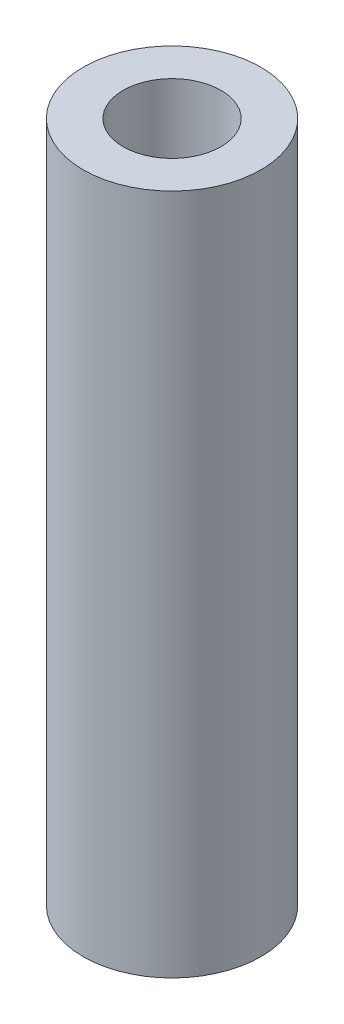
ISO-10303-21;
HEADER;
FILE_DESCRIPTION(('STEP AP214'),'2;1');
FILE_NAME('part.step','',(''),(''),'','','');
FILE_SCHEMA(('AUTOMOTIVE_DESIGN { 1 0 10303 214 1 1 1 1 }'));
ENDSEC;
DATA;
#1=APPLICATION_CONTEXT('core data for automotive mechanical design processes');
#2=APPLICATION_PROTOCOL_DEFINITION('international standard','automotive_design',2000,#1);
#3=PRODUCT_CONTEXT('',#1,'mechanical');
#4=PRODUCT('Part','Part','',(#3));
#5=PRODUCT_RELATED_PRODUCT_CATEGORY('part','',(#4));
#6=PRODUCT_DEFINITION_FORMATION('','',#4);
#7=PRODUCT_DEFINITION_CONTEXT('part definition',#1,'design');
#8=PRODUCT_DEFINITION('design','',#6,#7);
#9=PRODUCT_DEFINITION_SHAPE('','',#8);
#10=(LENGTH_UNIT() NAMED_UNIT(*) SI_UNIT(.MILLI.,.METRE.));
#11=(NAMED_UNIT(*) PLANE_ANGLE_UNIT() SI_UNIT($,.RADIAN.));
#12=(NAMED_UNIT(*) SI_UNIT($,.STERADIAN.) SOLID_ANGLE_UNIT());
#13=UNCERTAINTY_MEASURE_WITH_UNIT(LENGTH_MEASURE(1.E-05),#10,'distance_accuracy_value','');
#14=(GEOMETRIC_REPRESENTATION_CONTEXT(3) GLOBAL_UNCERTAINTY_ASSIGNED_CONTEXT((#13)) GLOBAL_UNIT_ASSIGNED_CONTEXT((#10,
#11,#12)) REPRESENTATION_CONTEXT('',''));
#15=CARTESIAN_POINT('',(0.,0.,0.));
#16=DIRECTION('',(0.,0.,1.));
#17=DIRECTION('',(1.,0.,0.));
#18=AXIS2_PLACEMENT_3D('',#15,#16,#17);
#19=CARTESIAN_POINT('',(0.,0.5,0.));
#20=DIRECTION('',(0.,1.,0.));
#21=DIRECTION('',(0.,0.,1.));
#22=AXIS2_PLACEMENT_3D('',#19,#20,#21);
#23=PLANE('',#22);
#24=CARTESIAN_POINT('',(0.,0.5,0.));
#25=DIRECTION('',(0.,1.,0.));
#26=DIRECTION('',(0.,0.,1.));
#27=AXIS2_PLACEMENT_3D('',#24,#25,#26);
#28=CIRCLE('',#27,3.);
#29=CARTESIAN_POINT('',(0.,0.5,3.));
#30=VERTEX_POINT('',#29);
#31=EDGE_CURVE('E11',#30,#30,#28,.T.);
#32=ORIENTED_EDGE('',*,*,#31,.T.);
#33=EDGE_LOOP('',(#32));
#34=FACE_BOUND('',#33,.T.);
#35=CARTESIAN_POINT('',(0.,0.5,0.));
#36=DIRECTION('',(0.,1.,0.));
#37=DIRECTION('',(0.,0.,1.));
#38=AXIS2_PLACEMENT_3D('',#35,#36,#37);
#39=CIRCLE('',#38,1.65);
#40=CARTESIAN_POINT('',(0.,0.5,1.65));
#41=VERTEX_POINT('',#40);
#42=EDGE_CURVE('E62',#41,#41,#39,.T.);
#43=ORIENTED_EDGE('',*,*,#42,.F.);
#44=EDGE_LOOP('',(#43));
#45=FACE_BOUND('',#44,.T.);
#46=ADVANCED_FACE('F51',(#34,#45),#23,.T.);
#47=CARTESIAN_POINT('',(0.,0.,0.));
#48=DIRECTION('',(0.,1.,0.));
#49=DIRECTION('',(0.,0.,1.));
#50=AXIS2_PLACEMENT_3D('',#47,#48,#49);
#51=PLANE('',#50);
#52=CARTESIAN_POINT('',(0.,0.,0.));
#53=DIRECTION('',(0.,1.,0.));
#54=DIRECTION('',(0.,0.,1.));
#55=AXIS2_PLACEMENT_3D('',#52,#53,#54);
#56=CIRCLE('',#55,3.);
#57=CARTESIAN_POINT('',(0.,0.,3.));
#58=VERTEX_POINT('',#57);
#59=EDGE_CURVE('E55',#58,#58,#56,.T.);
#60=ORIENTED_EDGE('',*,*,#59,.F.);
#61=EDGE_LOOP('',(#60));
#62=FACE_BOUND('',#61,.T.);
#63=CARTESIAN_POINT('',(0.,0.,0.));
#64=DIRECTION('',(0.,1.,0.));
#65=DIRECTION('',(0.,0.,1.));
#66=AXIS2_PLACEMENT_3D('',#63,#64,#65);
#67=CIRCLE('',#66,1.65);
#68=CARTESIAN_POINT('',(0.,0.,1.65));
#69=VERTEX_POINT('',#68);
#70=EDGE_CURVE('E64',#69,#69,#67,.T.);
#71=ORIENTED_EDGE('',*,*,#70,.T.);
#72=EDGE_LOOP('',(#71));
#73=FACE_BOUND('',#72,.T.);
#74=ADVANCED_FACE('F74',(#62,#73),#51,.F.);
#75=CARTESIAN_POINT('',(0.,0.5,0.));
#76=DIRECTION('',(0.,-1.,0.));
#77=DIRECTION('',(0.,0.,-1.));
#78=AXIS2_PLACEMENT_3D('',#75,#76,#77);
#79=CYLINDRICAL_SURFACE('',#78,3.);
#80=ORIENTED_EDGE('',*,*,#31,.F.);
#81=EDGE_LOOP('',(#80));
#82=FACE_BOUND('',#81,.T.);
#83=ORIENTED_EDGE('',*,*,#59,.T.);
#84=EDGE_LOOP('',(#83));
#85=FACE_BOUND('',#84,.T.);
#86=ADVANCED_FACE('F53',(#82,#85),#79,.T.);
#87=CARTESIAN_POINT('',(0.,0.5,0.));
#88=DIRECTION('',(0.,-1.,0.));
#89=DIRECTION('',(0.,0.,-1.));
#90=AXIS2_PLACEMENT_3D('',#87,#88,#89);
#91=CYLINDRICAL_SURFACE('',#90,1.65);
#92=ORIENTED_EDGE('',*,*,#42,.T.);
#93=EDGE_LOOP('',(#92));
#94=FACE_BOUND('',#93,.T.);
#95=ORIENTED_EDGE('',*,*,#70,.F.);
#96=EDGE_LOOP('',(#95));
#97=FACE_BOUND('',#96,.T.);
#98=ADVANCED_FACE('F70',(#94,#97),#91,.F.);
#99=CLOSED_SHELL('',(#46,#74,#86,#98));
#100=MANIFOLD_SOLID_BREP('B2_NOT_SHOWN',#99);
#101=CARTESIAN_POINT('',(0.,1.,0.));
#102=DIRECTION('',(0.,1.,0.));
#103=DIRECTION('',(0.,0.,1.));
#104=AXIS2_PLACEMENT_3D('',#101,#102,#103);
#105=PLANE('',#104);
#106=CARTESIAN_POINT('',(0.,1.,0.));
#107=DIRECTION('',(0.,1.,0.));
#108=DIRECTION('',(0.,0.,1.));
#109=AXIS2_PLACEMENT_3D('',#106,#107,#108);
#110=CIRCLE('',#109,3.);
#111=CARTESIAN_POINT('',(0.,1.,3.));
#112=VERTEX_POINT('',#111);
#113=EDGE_CURVE('E50',#112,#112,#110,.T.);
#114=ORIENTED_EDGE('',*,*,#113,.T.);
#115=EDGE_LOOP('',(#114));
#116=FACE_BOUND('',#115,.T.);
#117=CARTESIAN_POINT('',(0.,1.,0.));
#118=DIRECTION('',(0.,1.,0.));
#119=DIRECTION('',(0.,0.,1.));
#120=AXIS2_PLACEMENT_3D('',#117,#118,#119);
#121=CIRCLE('',#120,1.65);
#122=CARTESIAN_POINT('',(0.,1.,1.65));
#123=VERTEX_POINT('',#122);
#124=EDGE_CURVE('E140',#123,#123,#121,.T.);
#125=ORIENTED_EDGE('',*,*,#124,.F.);
#126=EDGE_LOOP('',(#125));
#127=FACE_BOUND('',#126,.T.);
#128=ADVANCED_FACE('F127',(#116,#127),#105,.T.);
#129=CARTESIAN_POINT('',(0.,0.,0.));
#130=DIRECTION('',(0.,1.,0.));
#131=DIRECTION('',(0.,0.,1.));
#132=AXIS2_PLACEMENT_3D('',#129,#130,#131);
#133=PLANE('',#132);
#134=CARTESIAN_POINT('',(0.,0.,0.));
#135=DIRECTION('',(0.,1.,0.));
#136=DIRECTION('',(0.,0.,1.));
#137=AXIS2_PLACEMENT_3D('',#134,#135,#136);
#138=CIRCLE('',#137,3.);
#139=CARTESIAN_POINT('',(0.,0.,3.));
#140=VERTEX_POINT('',#139);
#141=EDGE_CURVE('E131',#140,#140,#138,.T.);
#142=ORIENTED_EDGE('',*,*,#141,.F.);
#143=EDGE_LOOP('',(#142));
#144=FACE_BOUND('',#143,.T.);
#145=CARTESIAN_POINT('',(0.,0.,0.));
#146=DIRECTION('',(0.,1.,0.));
#147=DIRECTION('',(0.,0.,1.));
#148=AXIS2_PLACEMENT_3D('',#145,#146,#147);
#149=CIRCLE('',#148,1.65);
#150=CARTESIAN_POINT('',(0.,0.,1.65));
#151=VERTEX_POINT('',#150);
#152=EDGE_CURVE('E142',#151,#151,#149,.T.);
#153=ORIENTED_EDGE('',*,*,#152,.T.);
#154=EDGE_LOOP('',(#153));
#155=FACE_BOUND('',#154,.T.);
#156=ADVANCED_FACE('F154',(#144,#155),#133,.F.);
#157=CARTESIAN_POINT('',(0.,1.,0.));
#158=DIRECTION('',(0.,-1.,0.));
#159=DIRECTION('',(0.,0.,-1.));
#160=AXIS2_PLACEMENT_3D('',#157,#158,#159);
#161=CYLINDRICAL_SURFACE('',#160,3.);
#162=ORIENTED_EDGE('',*,*,#113,.F.);
#163=EDGE_LOOP('',(#162));
#164=FACE_BOUND('',#163,.T.);
#165=ORIENTED_EDGE('',*,*,#141,.T.);
#166=EDGE_LOOP('',(#165));
#167=FACE_BOUND('',#166,.T.);
#168=ADVANCED_FACE('F129',(#164,#167),#161,.T.);
#169=CARTESIAN_POINT('',(0.,1.,0.));
#170=DIRECTION('',(0.,-1.,0.));
#171=DIRECTION('',(0.,0.,-1.));
#172=AXIS2_PLACEMENT_3D('',#169,#170,#171);
#173=CYLINDRICAL_SURFACE('',#172,1.65);
#174=ORIENTED_EDGE('',*,*,#124,.T.);
#175=EDGE_LOOP('',(#174));
#176=FACE_BOUND('',#175,.T.);
#177=ORIENTED_EDGE('',*,*,#152,.F.);
#178=EDGE_LOOP('',(#177));
#179=FACE_BOUND('',#178,.T.);
#180=ADVANCED_FACE('F150',(#176,#179),#173,.F.);
#181=CLOSED_SHELL('',(#128,#156,#168,#180));
#182=MANIFOLD_SOLID_BREP('B6_NOT_SHOWN',#181);
#183=CARTESIAN_POINT('',(0.,23.,0.));
#184=DIRECTION('',(0.,1.,0.));
#185=DIRECTION('',(0.,0.,1.));
#186=AXIS2_PLACEMENT_3D('',#183,#184,#185);
#187=PLANE('',#186);
#188=CARTESIAN_POINT('',(0.,23.,0.));
#189=DIRECTION('',(0.,1.,0.));
#190=DIRECTION('',(0.,0.,1.));
#191=AXIS2_PLACEMENT_3D('',#188,#189,#190);
#192=CIRCLE('',#191,3.);
#193=CARTESIAN_POINT('',(0.,23.,3.));
#194=VERTEX_POINT('',#193);
#195=EDGE_CURVE('E126',#194,#194,#192,.T.);
#196=ORIENTED_EDGE('',*,*,#195,.T.);
#197=EDGE_LOOP('',(#196));
#198=FACE_BOUND('',#197,.T.);
#199=CARTESIAN_POINT('',(0.,23.,0.));
#200=DIRECTION('',(0.,1.,0.));
#201=DIRECTION('',(0.,0.,1.));
#202=AXIS2_PLACEMENT_3D('',#199,#200,#201);
#203=CIRCLE('',#202,1.65);
#204=CARTESIAN_POINT('',(0.,23.,1.65));
#205=VERTEX_POINT('',#204);
#206=EDGE_CURVE('E213',#205,#205,#203,.T.);
#207=ORIENTED_EDGE('',*,*,#206,.F.);
#208=EDGE_LOOP('',(#207));
#209=FACE_BOUND('',#208,.T.);
#210=ADVANCED_FACE('F200',(#198,#209),#187,.T.);
#211=CARTESIAN_POINT('',(0.,0.,0.));
#212=DIRECTION('',(0.,1.,0.));
#213=DIRECTION('',(0.,0.,1.));
#214=AXIS2_PLACEMENT_3D('',#211,#212,#213);
#215=PLANE('',#214);
#216=CARTESIAN_POINT('',(0.,0.,0.));
#217=DIRECTION('',(0.,1.,0.));
#218=DIRECTION('',(0.,0.,1.));
#219=AXIS2_PLACEMENT_3D('',#216,#217,#218);
#220=CIRCLE('',#219,3.);
#221=CARTESIAN_POINT('',(0.,0.,3.));
#222=VERTEX_POINT('',#221);
#223=EDGE_CURVE('E204',#222,#222,#220,.T.);
#224=ORIENTED_EDGE('',*,*,#223,.F.);
#225=EDGE_LOOP('',(#224));
#226=FACE_BOUND('',#225,.T.);
#227=CARTESIAN_POINT('',(0.,0.,0.));
#228=DIRECTION('',(0.,1.,0.));
#229=DIRECTION('',(0.,0.,1.));
#230=AXIS2_PLACEMENT_3D('',#227,#228,#229);
#231=CIRCLE('',#230,1.65);
#232=CARTESIAN_POINT('',(0.,0.,1.65));
#233=VERTEX_POINT('',#232);
#234=EDGE_CURVE('E215',#233,#233,#231,.T.);
#235=ORIENTED_EDGE('',*,*,#234,.T.);
#236=EDGE_LOOP('',(#235));
#237=FACE_BOUND('',#236,.T.);
#238=ADVANCED_FACE('F227',(#226,#237),#215,.F.);
#239=CARTESIAN_POINT('',(0.,23.,0.));
#240=DIRECTION('',(0.,-1.,0.));
#241=DIRECTION('',(0.,0.,-1.));
#242=AXIS2_PLACEMENT_3D('',#239,#240,#241);
#243=CYLINDRICAL_SURFACE('',#242,3.);
#244=ORIENTED_EDGE('',*,*,#195,.F.);
#245=EDGE_LOOP('',(#244));
#246=FACE_BOUND('',#245,.T.);
#247=ORIENTED_EDGE('',*,*,#223,.T.);
#248=EDGE_LOOP('',(#247));
#249=FACE_BOUND('',#248,.T.);
#250=ADVANCED_FACE('F202',(#246,#249),#243,.T.);
#251=CARTESIAN_POINT('',(0.,23.,0.));
#252=DIRECTION('',(0.,-1.,0.));
#253=DIRECTION('',(0.,0.,-1.));
#254=AXIS2_PLACEMENT_3D('',#251,#252,#253);
#255=CYLINDRICAL_SURFACE('',#254,1.65);
#256=ORIENTED_EDGE('',*,*,#206,.T.);
#257=EDGE_LOOP('',(#256));
#258=FACE_BOUND('',#257,.T.);
#259=ORIENTED_EDGE('',*,*,#234,.F.);
#260=EDGE_LOOP('',(#259));
#261=FACE_BOUND('',#260,.T.);
#262=ADVANCED_FACE('F223',(#258,#261),#255,.F.);
#263=CLOSED_SHELL('',(#210,#238,#250,#262));
#264=MANIFOLD_SOLID_BREP('B45',#263);
#265=ADVANCED_BREP_SHAPE_REPRESENTATION('',(#18,#100,#182,#264),#14);
#266=SHAPE_DEFINITION_REPRESENTATION(#9,#265);
ENDSEC;
END-ISO-10303-21;
